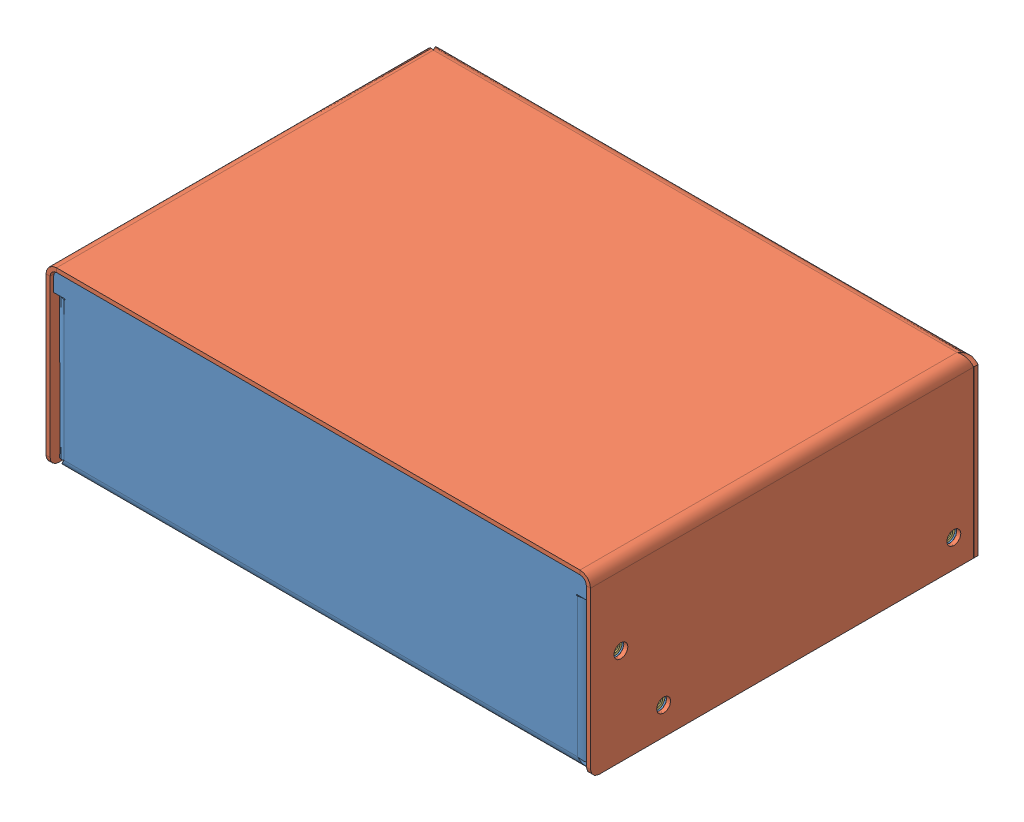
SolidWorks assembly L-Shape Assembly.SLDASM, configuration Default (file format 3400). Lengths in mm.
Overall size (161.99 52.28 115.07).
8 component instances, 3 part files, 16 mates.
Components (placement in the parent):
- Base-1: Base.SLDPRT [Default] at origin size (158.76 50.8 112.83)
- Cover-1: Cover.SLDPRT [Default] at (-80.8482 51.054 0.762) size (161.99 52.28 115.07)
- S-632-1 ZI-10: S-632-1 ZI.SLDPRT [PEM S-632-1 ZI--N] at (-78.1558 28.575 -8.255) x (0 -1 0) z (0 0 1) size (7.11 2.74 7.11)
- S-632-1 ZI-11: S-632-1 ZI.SLDPRT [PEM S-632-1 ZI--N] at (-78.1558 8.255 -20.955) x (0 -1 0) z (0 0 1) size (7.11 2.74 7.11)
- S-632-1 ZI-13: S-632-1 ZI.SLDPRT [PEM S-632-1 ZI--N] at (-78.1558 8.255 -107.1118) x (0 -1 0) z (0 0 1) size (7.11 2.74 7.11)
- S-632-1 ZI-1: S-632-1 ZI.SLDPRT [PEM S-440-1 ZI--N] at (78.1558 28.575 -8.255) x (0 1 0) z (0 0 1) size (6.35 2.74 6.35)
- S-632-1 ZI-4: S-632-1 ZI.SLDPRT [PEM S-440-1 ZI--N] at (78.1558 8.255 -20.955) x (0 1 0) z (0 0 1) size (6.35 2.74 6.35)
- S-632-1 ZI-5: S-632-1 ZI.SLDPRT [PEM S-440-1 ZI--N] at (78.1558 8.255 -107.1118) x (0 1 0) z (0 0 1) size (6.35 2.74 6.35)
Mates (geometry in assembly coordinates):
- Distance4: distance = 0.254 mm anti-aligned: plane of Base-1 through (79.375 50.8 0) normal (0 1 0); plane of Cover-1 through (207.2276 51.054 0.762) normal (0 -1 0)
- Distance6: distance = 0.762 mm aligned: plane of Base-1 through (79.375 50.8 0) normal (0 0 1); plane of Cover-1 through (207.2276 51.054 0.762) normal (0 0 1)
- Concentric71: concentric aligned: cylinder of Base-1
- Coincident141: coincident anti-aligned: unknown of Base-1
- Concentric81: concentric aligned: unknown of Base-1
- Coincident151: coincident anti-aligned: unknown of Base-1
- Concentric831: concentric aligned: unknown of Base-1
- Coincident1531: coincident anti-aligned: unknown of Base-1
- Distance7: distance = 0.254 mm anti-aligned: plane of Cover-1 through (-79.629 51.054 -111.1758) normal (1 0 0); plane of Base-1 through (-79.375 13.97 -15.24) normal (-1 0 0)
- Concentric83421: concentric anti-aligned: unknown of Base-1
- Coincident153621: coincident anti-aligned: unknown of Base-1
- Concentric83431: concentric anti-aligned: unknown of Base-1
- Coincident153631: coincident anti-aligned: unknown of Base-1
- Concentric83451: concentric anti-aligned: unknown of Base-1
- Coincident153651: coincident anti-aligned: unknown of Base-1
- PLANE1: unknown: moEndPointRef_w of Base-1; unknown of Base-1
